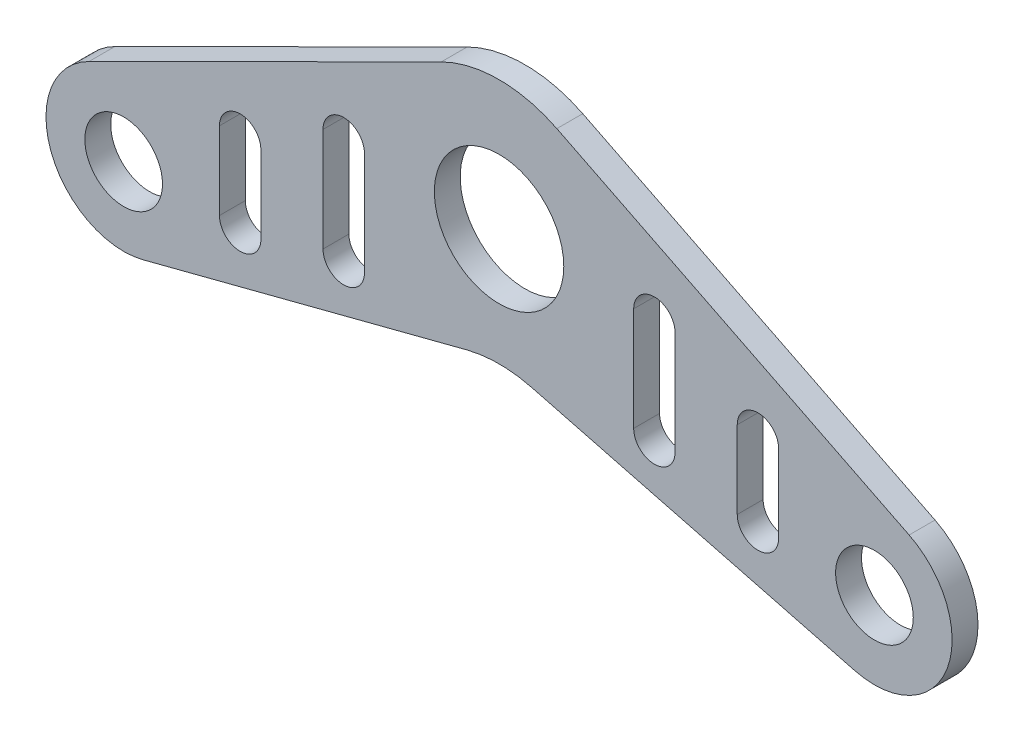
ISO-10303-21;
HEADER;
FILE_DESCRIPTION(('STEP AP214'),'2;1');
FILE_NAME('part.step','',(''),(''),'','','');
FILE_SCHEMA(('AUTOMOTIVE_DESIGN { 1 0 10303 214 1 1 1 1 }'));
ENDSEC;
DATA;
#1=APPLICATION_CONTEXT('core data for automotive mechanical design processes');
#2=APPLICATION_PROTOCOL_DEFINITION('international standard','automotive_design',2000,#1);
#3=PRODUCT_CONTEXT('',#1,'mechanical');
#4=PRODUCT('Part','Part','',(#3));
#5=PRODUCT_RELATED_PRODUCT_CATEGORY('part','',(#4));
#6=PRODUCT_DEFINITION_FORMATION('','',#4);
#7=PRODUCT_DEFINITION_CONTEXT('part definition',#1,'design');
#8=PRODUCT_DEFINITION('design','',#6,#7);
#9=PRODUCT_DEFINITION_SHAPE('','',#8);
#10=(LENGTH_UNIT() NAMED_UNIT(*) SI_UNIT(.MILLI.,.METRE.));
#11=(NAMED_UNIT(*) PLANE_ANGLE_UNIT() SI_UNIT($,.RADIAN.));
#12=(NAMED_UNIT(*) SI_UNIT($,.STERADIAN.) SOLID_ANGLE_UNIT());
#13=UNCERTAINTY_MEASURE_WITH_UNIT(LENGTH_MEASURE(1.E-05),#10,'distance_accuracy_value','');
#14=(GEOMETRIC_REPRESENTATION_CONTEXT(3) GLOBAL_UNCERTAINTY_ASSIGNED_CONTEXT((#13)) GLOBAL_UNIT_ASSIGNED_CONTEXT((#10,
#11,#12)) REPRESENTATION_CONTEXT('',''));
#15=CARTESIAN_POINT('',(0.,0.,0.));
#16=DIRECTION('',(0.,0.,1.));
#17=DIRECTION('',(1.,0.,0.));
#18=AXIS2_PLACEMENT_3D('',#15,#16,#17);
#19=CARTESIAN_POINT('',(-145.,-50.,10.));
#20=DIRECTION('',(0.,0.,1.));
#21=DIRECTION('',(1.,0.,0.));
#22=AXIS2_PLACEMENT_3D('',#19,#20,#21);
#23=PLANE('',#22);
#24=CARTESIAN_POINT('',(-60.,-0.689655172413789,10.));
#25=DIRECTION('',(0.,0.,1.));
#26=DIRECTION('',(1.,0.,0.));
#27=AXIS2_PLACEMENT_3D('',#24,#25,#26);
#28=CIRCLE('',#27,8.);
#29=CARTESIAN_POINT('',(-52.,-0.689655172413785,10.));
#30=VERTEX_POINT('',#29);
#31=CARTESIAN_POINT('',(-68.,-0.689655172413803,10.));
#32=VERTEX_POINT('',#31);
#33=EDGE_CURVE('E313',#30,#32,#28,.T.);
#34=ORIENTED_EDGE('',*,*,#33,.F.);
#35=DIRECTION('',(0.,1.,0.));
#36=VECTOR('',#35,1.);
#37=CARTESIAN_POINT('',(-52.,-0.689655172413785,10.));
#38=LINE('',#37,#36);
#39=CARTESIAN_POINT('',(-52.,-40.6896551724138,10.));
#40=VERTEX_POINT('',#39);
#41=EDGE_CURVE('E324',#40,#30,#38,.T.);
#42=ORIENTED_EDGE('',*,*,#41,.F.);
#43=CARTESIAN_POINT('',(-60.,-40.6896551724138,10.));
#44=DIRECTION('',(0.,0.,1.));
#45=DIRECTION('',(1.,0.,0.));
#46=AXIS2_PLACEMENT_3D('',#43,#44,#45);
#47=CIRCLE('',#46,8.);
#48=CARTESIAN_POINT('',(-68.,-40.6896551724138,10.));
#49=VERTEX_POINT('',#48);
#50=EDGE_CURVE('E320',#49,#40,#47,.T.);
#51=ORIENTED_EDGE('',*,*,#50,.F.);
#52=DIRECTION('',(0.,-1.,0.));
#53=VECTOR('',#52,1.);
#54=CARTESIAN_POINT('',(-68.,-0.689655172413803,10.));
#55=LINE('',#54,#53);
#56=EDGE_CURVE('E316',#32,#49,#55,.T.);
#57=ORIENTED_EDGE('',*,*,#56,.F.);
#58=EDGE_LOOP('',(#34,#42,#51,#57));
#59=FACE_BOUND('',#58,.T.);
#60=CARTESIAN_POINT('',(-100.,-19.4827586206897,10.));
#61=DIRECTION('',(0.,0.,1.));
#62=DIRECTION('',(1.,0.,0.));
#63=AXIS2_PLACEMENT_3D('',#60,#61,#62);
#64=CIRCLE('',#63,7.99999999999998);
#65=CARTESIAN_POINT('',(-92.,-19.4827586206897,10.));
#66=VERTEX_POINT('',#65);
#67=CARTESIAN_POINT('',(-108.,-19.4827586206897,10.));
#68=VERTEX_POINT('',#67);
#69=EDGE_CURVE('E356',#66,#68,#64,.T.);
#70=ORIENTED_EDGE('',*,*,#69,.F.);
#71=DIRECTION('',(0.,1.,0.));
#72=VECTOR('',#71,1.);
#73=CARTESIAN_POINT('',(-92.,-19.4827586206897,10.));
#74=LINE('',#73,#72);
#75=CARTESIAN_POINT('',(-92.,-49.4827586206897,10.));
#76=VERTEX_POINT('',#75);
#77=EDGE_CURVE('E367',#76,#66,#74,.T.);
#78=ORIENTED_EDGE('',*,*,#77,.F.);
#79=CARTESIAN_POINT('',(-100.,-49.4827586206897,10.));
#80=DIRECTION('',(0.,0.,1.));
#81=DIRECTION('',(1.,0.,0.));
#82=AXIS2_PLACEMENT_3D('',#79,#80,#81);
#83=CIRCLE('',#82,7.99999999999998);
#84=CARTESIAN_POINT('',(-108.,-49.4827586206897,10.));
#85=VERTEX_POINT('',#84);
#86=EDGE_CURVE('E363',#85,#76,#83,.T.);
#87=ORIENTED_EDGE('',*,*,#86,.F.);
#88=DIRECTION('',(0.,-1.,0.));
#89=VECTOR('',#88,1.);
#90=CARTESIAN_POINT('',(-108.,-19.4827586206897,10.));
#91=LINE('',#90,#89);
#92=EDGE_CURVE('E359',#68,#85,#91,.T.);
#93=ORIENTED_EDGE('',*,*,#92,.F.);
#94=EDGE_LOOP('',(#70,#78,#87,#93));
#95=FACE_BOUND('',#94,.T.);
#96=CARTESIAN_POINT('',(0.,0.,10.));
#97=DIRECTION('',(0.,0.,1.));
#98=DIRECTION('',(1.,0.,0.));
#99=AXIS2_PLACEMENT_3D('',#96,#97,#98);
#100=CIRCLE('',#99,25.);
#101=CARTESIAN_POINT('',(25.,0.,10.));
#102=VERTEX_POINT('',#101);
#103=EDGE_CURVE('E395',#102,#102,#100,.T.);
#104=ORIENTED_EDGE('',*,*,#103,.F.);
#105=EDGE_LOOP('',(#104));
#106=FACE_BOUND('',#105,.T.);
#107=CARTESIAN_POINT('',(-145.,-50.,10.));
#108=DIRECTION('',(0.,0.,1.));
#109=DIRECTION('',(1.,0.,0.));
#110=AXIS2_PLACEMENT_3D('',#107,#108,#109);
#111=CIRCLE('',#110,30.);
#112=CARTESIAN_POINT('',(-158.394414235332,-23.1561987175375,10.));
#113=VERTEX_POINT('',#112);
#114=CARTESIAN_POINT('',(-137.479425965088,-79.0420551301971,10.));
#115=VERTEX_POINT('',#114);
#116=EDGE_CURVE('E411',#113,#115,#111,.T.);
#117=ORIENTED_EDGE('',*,*,#116,.T.);
#118=DIRECTION('',(0.968068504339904,0.25068580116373,0.));
#119=VECTOR('',#118,1.);
#120=CARTESIAN_POINT('',(-137.479425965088,-79.0420551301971,10.));
#121=LINE('',#120,#119);
#122=CARTESIAN_POINT('',(-12.5342900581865,-46.6869362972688,10.));
#123=VERTEX_POINT('',#122);
#124=EDGE_CURVE('E415',#115,#123,#121,.T.);
#125=ORIENTED_EDGE('',*,*,#124,.T.);
#126=CARTESIAN_POINT('',(0.,-95.090361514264,10.));
#127=DIRECTION('',(0.,0.,-1.));
#128=DIRECTION('',(-1.,0.,0.));
#129=AXIS2_PLACEMENT_3D('',#126,#127,#128);
#130=CIRCLE('',#129,50.);
#131=CARTESIAN_POINT('',(12.5342900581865,-46.6869362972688,10.));
#132=VERTEX_POINT('',#131);
#133=EDGE_CURVE('E419',#123,#132,#130,.T.);
#134=ORIENTED_EDGE('',*,*,#133,.T.);
#135=DIRECTION('',(0.968068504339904,-0.25068580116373,0.));
#136=VECTOR('',#135,1.);
#137=CARTESIAN_POINT('',(12.5342900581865,-46.6869362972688,10.));
#138=LINE('',#137,#136);
#139=CARTESIAN_POINT('',(137.479425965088,-79.0420551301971,10.));
#140=VERTEX_POINT('',#139);
#141=EDGE_CURVE('E422',#132,#140,#138,.T.);
#142=ORIENTED_EDGE('',*,*,#141,.T.);
#143=CARTESIAN_POINT('',(145.,-50.,10.));
#144=DIRECTION('',(0.,0.,1.));
#145=DIRECTION('',(1.,0.,0.));
#146=AXIS2_PLACEMENT_3D('',#143,#144,#145);
#147=CIRCLE('',#146,30.);
#148=CARTESIAN_POINT('',(158.394414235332,-23.1561987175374,10.));
#149=VERTEX_POINT('',#148);
#150=EDGE_CURVE('E425',#140,#149,#147,.T.);
#151=ORIENTED_EDGE('',*,*,#150,.T.);
#152=DIRECTION('',(-0.894793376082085,0.446480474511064,0.));
#153=VECTOR('',#152,1.);
#154=CARTESIAN_POINT('',(22.3240237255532,44.7396688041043,10.));
#155=LINE('',#154,#153);
#156=CARTESIAN_POINT('',(22.3240237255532,44.7396688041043,10.));
#157=VERTEX_POINT('',#156);
#158=EDGE_CURVE('E428',#149,#157,#155,.T.);
#159=ORIENTED_EDGE('',*,*,#158,.T.);
#160=CARTESIAN_POINT('',(0.,0.,10.));
#161=DIRECTION('',(0.,0.,1.));
#162=DIRECTION('',(1.,0.,0.));
#163=AXIS2_PLACEMENT_3D('',#160,#161,#162);
#164=CIRCLE('',#163,50.);
#165=CARTESIAN_POINT('',(-22.3240237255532,44.7396688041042,10.));
#166=VERTEX_POINT('',#165);
#167=EDGE_CURVE('E431',#157,#166,#164,.T.);
#168=ORIENTED_EDGE('',*,*,#167,.T.);
#169=DIRECTION('',(-0.894793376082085,-0.446480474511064,0.));
#170=VECTOR('',#169,1.);
#171=CARTESIAN_POINT('',(-158.394414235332,-23.1561987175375,10.));
#172=LINE('',#171,#170);
#173=EDGE_CURVE('E434',#166,#113,#172,.T.);
#174=ORIENTED_EDGE('',*,*,#173,.T.);
#175=EDGE_LOOP('',(#117,#125,#134,#142,#151,#159,#168,#174));
#176=FACE_BOUND('',#175,.T.);
#177=CARTESIAN_POINT('',(145.,-50.,10.));
#178=DIRECTION('',(0.,0.,1.));
#179=DIRECTION('',(1.,0.,0.));
#180=AXIS2_PLACEMENT_3D('',#177,#178,#179);
#181=CIRCLE('',#180,15.);
#182=CARTESIAN_POINT('',(160.,-50.,10.));
#183=VERTEX_POINT('',#182);
#184=EDGE_CURVE('E403',#183,#183,#181,.T.);
#185=ORIENTED_EDGE('',*,*,#184,.F.);
#186=EDGE_LOOP('',(#185));
#187=FACE_BOUND('',#186,.T.);
#188=CARTESIAN_POINT('',(-145.,-50.,10.));
#189=DIRECTION('',(0.,0.,1.));
#190=DIRECTION('',(1.,0.,0.));
#191=AXIS2_PLACEMENT_3D('',#188,#189,#190);
#192=CIRCLE('',#191,15.);
#193=CARTESIAN_POINT('',(-130.,-50.,10.));
#194=VERTEX_POINT('',#193);
#195=EDGE_CURVE('E387',#194,#194,#192,.T.);
#196=ORIENTED_EDGE('',*,*,#195,.F.);
#197=EDGE_LOOP('',(#196));
#198=FACE_BOUND('',#197,.T.);
#199=DIRECTION('',(0.,1.,0.));
#200=VECTOR('',#199,1.);
#201=CARTESIAN_POINT('',(92.,-19.4827586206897,10.));
#202=LINE('',#201,#200);
#203=CARTESIAN_POINT('',(92.,-49.4827586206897,10.));
#204=VERTEX_POINT('',#203);
#205=CARTESIAN_POINT('',(92.,-19.4827586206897,10.));
#206=VERTEX_POINT('',#205);
#207=EDGE_CURVE('E273',#204,#206,#202,.T.);
#208=ORIENTED_EDGE('',*,*,#207,.T.);
#209=CARTESIAN_POINT('',(100.,-19.4827586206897,10.));
#210=DIRECTION('',(0.,0.,-1.));
#211=DIRECTION('',(-1.,0.,0.));
#212=AXIS2_PLACEMENT_3D('',#209,#210,#211);
#213=CIRCLE('',#212,7.99999999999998);
#214=CARTESIAN_POINT('',(108.,-19.4827586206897,10.));
#215=VERTEX_POINT('',#214);
#216=EDGE_CURVE('E71',#206,#215,#213,.T.);
#217=ORIENTED_EDGE('',*,*,#216,.T.);
#218=DIRECTION('',(0.,-1.,0.));
#219=VECTOR('',#218,1.);
#220=CARTESIAN_POINT('',(108.,-19.4827586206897,10.));
#221=LINE('',#220,#219);
#222=CARTESIAN_POINT('',(108.,-49.4827586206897,10.));
#223=VERTEX_POINT('',#222);
#224=EDGE_CURVE('E281',#215,#223,#221,.T.);
#225=ORIENTED_EDGE('',*,*,#224,.T.);
#226=CARTESIAN_POINT('',(100.,-49.4827586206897,10.));
#227=DIRECTION('',(0.,0.,-1.));
#228=DIRECTION('',(-1.,0.,0.));
#229=AXIS2_PLACEMENT_3D('',#226,#227,#228);
#230=CIRCLE('',#229,7.99999999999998);
#231=EDGE_CURVE('E277',#223,#204,#230,.T.);
#232=ORIENTED_EDGE('',*,*,#231,.T.);
#233=EDGE_LOOP('',(#208,#217,#225,#232));
#234=FACE_BOUND('',#233,.T.);
#235=DIRECTION('',(0.,1.,0.));
#236=VECTOR('',#235,1.);
#237=CARTESIAN_POINT('',(52.,-0.689655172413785,10.));
#238=LINE('',#237,#236);
#239=CARTESIAN_POINT('',(52.,-40.6896551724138,10.));
#240=VERTEX_POINT('',#239);
#241=CARTESIAN_POINT('',(52.,-0.689655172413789,10.));
#242=VERTEX_POINT('',#241);
#243=EDGE_CURVE('E237',#240,#242,#238,.T.);
#244=ORIENTED_EDGE('',*,*,#243,.T.);
#245=CARTESIAN_POINT('',(60.,-0.689655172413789,10.));
#246=DIRECTION('',(0.,0.,-1.));
#247=DIRECTION('',(-1.,0.,0.));
#248=AXIS2_PLACEMENT_3D('',#245,#246,#247);
#249=CIRCLE('',#248,8.);
#250=CARTESIAN_POINT('',(68.,-0.689655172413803,10.));
#251=VERTEX_POINT('',#250);
#252=EDGE_CURVE('E63',#242,#251,#249,.T.);
#253=ORIENTED_EDGE('',*,*,#252,.T.);
#254=DIRECTION('',(0.,-1.,0.));
#255=VECTOR('',#254,1.);
#256=CARTESIAN_POINT('',(68.,-0.689655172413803,10.));
#257=LINE('',#256,#255);
#258=CARTESIAN_POINT('',(68.,-40.6896551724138,10.));
#259=VERTEX_POINT('',#258);
#260=EDGE_CURVE('E228',#251,#259,#257,.T.);
#261=ORIENTED_EDGE('',*,*,#260,.T.);
#262=CARTESIAN_POINT('',(60.,-40.6896551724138,10.));
#263=DIRECTION('',(0.,0.,-1.));
#264=DIRECTION('',(-1.,0.,0.));
#265=AXIS2_PLACEMENT_3D('',#262,#263,#264);
#266=CIRCLE('',#265,8.);
#267=EDGE_CURVE('E245',#259,#240,#266,.T.);
#268=ORIENTED_EDGE('',*,*,#267,.T.);
#269=EDGE_LOOP('',(#244,#253,#261,#268));
#270=FACE_BOUND('',#269,.T.);
#271=ADVANCED_FACE('F47',(#59,#95,#106,#176,#187,#198,#234,#270),#23,.T.);
#272=CARTESIAN_POINT('',(-145.,-50.,0.));
#273=DIRECTION('',(0.,0.,1.));
#274=DIRECTION('',(1.,0.,0.));
#275=AXIS2_PLACEMENT_3D('',#272,#273,#274);
#276=PLANE('',#275);
#277=CARTESIAN_POINT('',(100.,-19.4827586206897,0.));
#278=DIRECTION('',(0.,0.,1.));
#279=DIRECTION('',(1.,0.,0.));
#280=AXIS2_PLACEMENT_3D('',#277,#278,#279);
#281=CIRCLE('',#280,7.99999999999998);
#282=CARTESIAN_POINT('',(108.,-19.4827586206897,0.));
#283=VERTEX_POINT('',#282);
#284=CARTESIAN_POINT('',(92.,-19.4827586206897,0.));
#285=VERTEX_POINT('',#284);
#286=EDGE_CURVE('E267',#283,#285,#281,.T.);
#287=ORIENTED_EDGE('',*,*,#286,.T.);
#288=DIRECTION('',(0.,-1.,0.));
#289=VECTOR('',#288,1.);
#290=CARTESIAN_POINT('',(92.,-19.4827586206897,0.));
#291=LINE('',#290,#289);
#292=CARTESIAN_POINT('',(92.,-49.4827586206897,0.));
#293=VERTEX_POINT('',#292);
#294=EDGE_CURVE('E289',#285,#293,#291,.T.);
#295=ORIENTED_EDGE('',*,*,#294,.T.);
#296=CARTESIAN_POINT('',(100.,-49.4827586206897,0.));
#297=DIRECTION('',(0.,0.,1.));
#298=DIRECTION('',(1.,0.,0.));
#299=AXIS2_PLACEMENT_3D('',#296,#297,#298);
#300=CIRCLE('',#299,7.99999999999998);
#301=CARTESIAN_POINT('',(108.,-49.4827586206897,0.));
#302=VERTEX_POINT('',#301);
#303=EDGE_CURVE('E259',#293,#302,#300,.T.);
#304=ORIENTED_EDGE('',*,*,#303,.T.);
#305=DIRECTION('',(0.,1.,0.));
#306=VECTOR('',#305,1.);
#307=CARTESIAN_POINT('',(108.,-19.4827586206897,0.));
#308=LINE('',#307,#306);
#309=EDGE_CURVE('E263',#302,#283,#308,.T.);
#310=ORIENTED_EDGE('',*,*,#309,.T.);
#311=EDGE_LOOP('',(#287,#295,#304,#310));
#312=FACE_BOUND('',#311,.T.);
#313=DIRECTION('',(0.,-1.,0.));
#314=VECTOR('',#313,1.);
#315=CARTESIAN_POINT('',(-52.,-0.689655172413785,0.));
#316=LINE('',#315,#314);
#317=CARTESIAN_POINT('',(-52.,-0.689655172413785,0.));
#318=VERTEX_POINT('',#317);
#319=CARTESIAN_POINT('',(-52.,-40.6896551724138,0.));
#320=VERTEX_POINT('',#319);
#321=EDGE_CURVE('E304',#318,#320,#316,.T.);
#322=ORIENTED_EDGE('',*,*,#321,.F.);
#323=CARTESIAN_POINT('',(-60.,-0.689655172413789,0.));
#324=DIRECTION('',(0.,0.,1.));
#325=DIRECTION('',(1.,0.,0.));
#326=AXIS2_PLACEMENT_3D('',#323,#324,#325);
#327=CIRCLE('',#326,8.);
#328=CARTESIAN_POINT('',(-68.,-0.689655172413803,0.));
#329=VERTEX_POINT('',#328);
#330=EDGE_CURVE('E309',#329,#318,#327,.F.);
#331=ORIENTED_EDGE('',*,*,#330,.F.);
#332=DIRECTION('',(0.,1.,0.));
#333=VECTOR('',#332,1.);
#334=CARTESIAN_POINT('',(-68.,-0.689655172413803,0.));
#335=LINE('',#334,#333);
#336=CARTESIAN_POINT('',(-68.,-40.6896551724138,0.));
#337=VERTEX_POINT('',#336);
#338=EDGE_CURVE('E332',#337,#329,#335,.T.);
#339=ORIENTED_EDGE('',*,*,#338,.F.);
#340=CARTESIAN_POINT('',(-60.,-40.6896551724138,0.));
#341=DIRECTION('',(0.,0.,1.));
#342=DIRECTION('',(1.,0.,0.));
#343=AXIS2_PLACEMENT_3D('',#340,#341,#342);
#344=CIRCLE('',#343,8.);
#345=EDGE_CURVE('E301',#320,#337,#344,.F.);
#346=ORIENTED_EDGE('',*,*,#345,.F.);
#347=EDGE_LOOP('',(#322,#331,#339,#346));
#348=FACE_BOUND('',#347,.T.);
#349=DIRECTION('',(0.,-1.,0.));
#350=VECTOR('',#349,1.);
#351=CARTESIAN_POINT('',(-92.,-19.4827586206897,0.));
#352=LINE('',#351,#350);
#353=CARTESIAN_POINT('',(-92.,-19.4827586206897,0.));
#354=VERTEX_POINT('',#353);
#355=CARTESIAN_POINT('',(-92.,-49.4827586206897,0.));
#356=VERTEX_POINT('',#355);
#357=EDGE_CURVE('E348',#354,#356,#352,.T.);
#358=ORIENTED_EDGE('',*,*,#357,.F.);
#359=CARTESIAN_POINT('',(-100.,-19.4827586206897,0.));
#360=DIRECTION('',(0.,0.,1.));
#361=DIRECTION('',(1.,0.,0.));
#362=AXIS2_PLACEMENT_3D('',#359,#360,#361);
#363=CIRCLE('',#362,7.99999999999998);
#364=CARTESIAN_POINT('',(-108.,-19.4827586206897,0.));
#365=VERTEX_POINT('',#364);
#366=EDGE_CURVE('E352',#365,#354,#363,.F.);
#367=ORIENTED_EDGE('',*,*,#366,.F.);
#368=DIRECTION('',(0.,1.,0.));
#369=VECTOR('',#368,1.);
#370=CARTESIAN_POINT('',(-108.,-19.4827586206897,0.));
#371=LINE('',#370,#369);
#372=CARTESIAN_POINT('',(-108.,-49.4827586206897,0.));
#373=VERTEX_POINT('',#372);
#374=EDGE_CURVE('E305',#373,#365,#371,.T.);
#375=ORIENTED_EDGE('',*,*,#374,.F.);
#376=CARTESIAN_POINT('',(-100.,-49.4827586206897,0.));
#377=DIRECTION('',(0.,0.,1.));
#378=DIRECTION('',(1.,0.,0.));
#379=AXIS2_PLACEMENT_3D('',#376,#377,#378);
#380=CIRCLE('',#379,7.99999999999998);
#381=EDGE_CURVE('E221',#356,#373,#380,.F.);
#382=ORIENTED_EDGE('',*,*,#381,.F.);
#383=EDGE_LOOP('',(#358,#367,#375,#382));
#384=FACE_BOUND('',#383,.T.);
#385=CARTESIAN_POINT('',(-145.,-50.,0.));
#386=DIRECTION('',(0.,0.,1.));
#387=DIRECTION('',(1.,0.,0.));
#388=AXIS2_PLACEMENT_3D('',#385,#386,#387);
#389=CIRCLE('',#388,30.);
#390=CARTESIAN_POINT('',(-158.394414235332,-23.1561987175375,0.));
#391=VERTEX_POINT('',#390);
#392=CARTESIAN_POINT('',(-137.479425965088,-79.0420551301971,0.));
#393=VERTEX_POINT('',#392);
#394=EDGE_CURVE('E407',#391,#393,#389,.T.);
#395=ORIENTED_EDGE('',*,*,#394,.F.);
#396=DIRECTION('',(-0.894793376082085,-0.446480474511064,0.));
#397=VECTOR('',#396,1.);
#398=CARTESIAN_POINT('',(-158.394414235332,-23.1561987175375,0.));
#399=LINE('',#398,#397);
#400=CARTESIAN_POINT('',(-22.3240237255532,44.7396688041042,0.));
#401=VERTEX_POINT('',#400);
#402=EDGE_CURVE('E416',#401,#391,#399,.T.);
#403=ORIENTED_EDGE('',*,*,#402,.F.);
#404=CARTESIAN_POINT('',(0.,0.,0.));
#405=DIRECTION('',(0.,0.,1.));
#406=DIRECTION('',(1.,0.,0.));
#407=AXIS2_PLACEMENT_3D('',#404,#405,#406);
#408=CIRCLE('',#407,50.);
#409=CARTESIAN_POINT('',(22.3240237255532,44.7396688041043,0.));
#410=VERTEX_POINT('',#409);
#411=EDGE_CURVE('E456',#410,#401,#408,.T.);
#412=ORIENTED_EDGE('',*,*,#411,.F.);
#413=DIRECTION('',(-0.894793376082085,0.446480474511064,0.));
#414=VECTOR('',#413,1.);
#415=CARTESIAN_POINT('',(22.3240237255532,44.7396688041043,0.));
#416=LINE('',#415,#414);
#417=CARTESIAN_POINT('',(158.394414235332,-23.1561987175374,0.));
#418=VERTEX_POINT('',#417);
#419=EDGE_CURVE('E453',#418,#410,#416,.T.);
#420=ORIENTED_EDGE('',*,*,#419,.F.);
#421=CARTESIAN_POINT('',(145.,-50.,0.));
#422=DIRECTION('',(0.,0.,1.));
#423=DIRECTION('',(1.,0.,0.));
#424=AXIS2_PLACEMENT_3D('',#421,#422,#423);
#425=CIRCLE('',#424,30.);
#426=CARTESIAN_POINT('',(137.479425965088,-79.0420551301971,0.));
#427=VERTEX_POINT('',#426);
#428=EDGE_CURVE('E450',#427,#418,#425,.T.);
#429=ORIENTED_EDGE('',*,*,#428,.F.);
#430=DIRECTION('',(0.968068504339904,-0.25068580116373,0.));
#431=VECTOR('',#430,1.);
#432=CARTESIAN_POINT('',(12.5342900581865,-46.6869362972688,0.));
#433=LINE('',#432,#431);
#434=CARTESIAN_POINT('',(12.5342900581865,-46.6869362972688,0.));
#435=VERTEX_POINT('',#434);
#436=EDGE_CURVE('E447',#435,#427,#433,.T.);
#437=ORIENTED_EDGE('',*,*,#436,.F.);
#438=CARTESIAN_POINT('',(0.,-95.090361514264,0.));
#439=DIRECTION('',(0.,0.,-1.));
#440=DIRECTION('',(-1.,0.,0.));
#441=AXIS2_PLACEMENT_3D('',#438,#439,#440);
#442=CIRCLE('',#441,50.);
#443=CARTESIAN_POINT('',(-12.5342900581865,-46.6869362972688,0.));
#444=VERTEX_POINT('',#443);
#445=EDGE_CURVE('E444',#444,#435,#442,.T.);
#446=ORIENTED_EDGE('',*,*,#445,.F.);
#447=DIRECTION('',(0.968068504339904,0.25068580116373,0.));
#448=VECTOR('',#447,1.);
#449=CARTESIAN_POINT('',(-137.479425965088,-79.0420551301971,0.));
#450=LINE('',#449,#448);
#451=EDGE_CURVE('E441',#393,#444,#450,.T.);
#452=ORIENTED_EDGE('',*,*,#451,.F.);
#453=EDGE_LOOP('',(#395,#403,#412,#420,#429,#437,#446,#452));
#454=FACE_BOUND('',#453,.T.);
#455=CARTESIAN_POINT('',(145.,-50.,0.));
#456=DIRECTION('',(0.,0.,1.));
#457=DIRECTION('',(1.,0.,0.));
#458=AXIS2_PLACEMENT_3D('',#455,#456,#457);
#459=CIRCLE('',#458,15.);
#460=CARTESIAN_POINT('',(160.,-50.,0.));
#461=VERTEX_POINT('',#460);
#462=EDGE_CURVE('E399',#461,#461,#459,.T.);
#463=ORIENTED_EDGE('',*,*,#462,.T.);
#464=EDGE_LOOP('',(#463));
#465=FACE_BOUND('',#464,.T.);
#466=CARTESIAN_POINT('',(0.,0.,0.));
#467=DIRECTION('',(0.,0.,1.));
#468=DIRECTION('',(1.,0.,0.));
#469=AXIS2_PLACEMENT_3D('',#466,#467,#468);
#470=CIRCLE('',#469,25.);
#471=CARTESIAN_POINT('',(25.,0.,0.));
#472=VERTEX_POINT('',#471);
#473=EDGE_CURVE('E391',#472,#472,#470,.T.);
#474=ORIENTED_EDGE('',*,*,#473,.T.);
#475=EDGE_LOOP('',(#474));
#476=FACE_BOUND('',#475,.T.);
#477=CARTESIAN_POINT('',(-145.,-50.,0.));
#478=DIRECTION('',(0.,0.,1.));
#479=DIRECTION('',(1.,0.,0.));
#480=AXIS2_PLACEMENT_3D('',#477,#478,#479);
#481=CIRCLE('',#480,15.);
#482=CARTESIAN_POINT('',(-130.,-50.,0.));
#483=VERTEX_POINT('',#482);
#484=EDGE_CURVE('E345',#483,#483,#481,.T.);
#485=ORIENTED_EDGE('',*,*,#484,.T.);
#486=EDGE_LOOP('',(#485));
#487=FACE_BOUND('',#486,.T.);
#488=CARTESIAN_POINT('',(60.,-0.689655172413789,0.));
#489=DIRECTION('',(0.,0.,1.));
#490=DIRECTION('',(1.,0.,0.));
#491=AXIS2_PLACEMENT_3D('',#488,#489,#490);
#492=CIRCLE('',#491,8.);
#493=CARTESIAN_POINT('',(68.,-0.689655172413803,0.));
#494=VERTEX_POINT('',#493);
#495=CARTESIAN_POINT('',(52.,-0.689655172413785,0.));
#496=VERTEX_POINT('',#495);
#497=EDGE_CURVE('E225',#494,#496,#492,.T.);
#498=ORIENTED_EDGE('',*,*,#497,.T.);
#499=DIRECTION('',(0.,-1.,0.));
#500=VECTOR('',#499,1.);
#501=CARTESIAN_POINT('',(52.,-0.689655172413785,0.));
#502=LINE('',#501,#500);
#503=CARTESIAN_POINT('',(52.,-40.6896551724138,0.));
#504=VERTEX_POINT('',#503);
#505=EDGE_CURVE('E210',#496,#504,#502,.T.);
#506=ORIENTED_EDGE('',*,*,#505,.T.);
#507=CARTESIAN_POINT('',(60.,-40.6896551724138,0.));
#508=DIRECTION('',(0.,0.,1.));
#509=DIRECTION('',(1.,0.,0.));
#510=AXIS2_PLACEMENT_3D('',#507,#508,#509);
#511=CIRCLE('',#510,8.);
#512=CARTESIAN_POINT('',(68.,-40.6896551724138,0.));
#513=VERTEX_POINT('',#512);
#514=EDGE_CURVE('E239',#504,#513,#511,.T.);
#515=ORIENTED_EDGE('',*,*,#514,.T.);
#516=DIRECTION('',(0.,1.,0.));
#517=VECTOR('',#516,1.);
#518=CARTESIAN_POINT('',(68.,-0.689655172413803,0.));
#519=LINE('',#518,#517);
#520=EDGE_CURVE('E232',#513,#494,#519,.T.);
#521=ORIENTED_EDGE('',*,*,#520,.T.);
#522=EDGE_LOOP('',(#498,#506,#515,#521));
#523=FACE_BOUND('',#522,.T.);
#524=ADVANCED_FACE('F231',(#312,#348,#384,#454,#465,#476,#487,#523),#276,.F.);
#525=CARTESIAN_POINT('',(-145.,-50.,10.));
#526=DIRECTION('',(0.,0.,-1.));
#527=DIRECTION('',(-1.,0.,0.));
#528=AXIS2_PLACEMENT_3D('',#525,#526,#527);
#529=CYLINDRICAL_SURFACE('',#528,30.);
#530=ORIENTED_EDGE('',*,*,#394,.T.);
#531=DIRECTION('',(0.,0.,-1.));
#532=VECTOR('',#531,1.);
#533=CARTESIAN_POINT('',(-137.479425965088,-79.0420551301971,10.));
#534=LINE('',#533,#532);
#535=EDGE_CURVE('E11',#115,#393,#534,.T.);
#536=ORIENTED_EDGE('',*,*,#535,.F.);
#537=ORIENTED_EDGE('',*,*,#116,.F.);
#538=DIRECTION('',(0.,0.,-1.));
#539=VECTOR('',#538,1.);
#540=CARTESIAN_POINT('',(-158.394414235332,-23.1561987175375,10.));
#541=LINE('',#540,#539);
#542=EDGE_CURVE('E437',#113,#391,#541,.T.);
#543=ORIENTED_EDGE('',*,*,#542,.T.);
#544=EDGE_LOOP('',(#530,#536,#537,#543));
#545=FACE_BOUND('',#544,.T.);
#546=ADVANCED_FACE('F49',(#545),#529,.T.);
#547=CARTESIAN_POINT('',(-137.479425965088,-79.0420551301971,10.));
#548=DIRECTION('',(-0.25068580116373,0.968068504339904,0.));
#549=DIRECTION('',(-0.968068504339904,-0.25068580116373,0.));
#550=AXIS2_PLACEMENT_3D('',#547,#548,#549);
#551=PLANE('',#550);
#552=ORIENTED_EDGE('',*,*,#451,.T.);
#553=DIRECTION('',(0.,0.,-1.));
#554=VECTOR('',#553,1.);
#555=CARTESIAN_POINT('',(-12.5342900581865,-46.6869362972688,10.));
#556=LINE('',#555,#554);
#557=EDGE_CURVE('E56',#123,#444,#556,.T.);
#558=ORIENTED_EDGE('',*,*,#557,.F.);
#559=ORIENTED_EDGE('',*,*,#124,.F.);
#560=ORIENTED_EDGE('',*,*,#535,.T.);
#561=EDGE_LOOP('',(#552,#558,#559,#560));
#562=FACE_BOUND('',#561,.T.);
#563=ADVANCED_FACE('F512',(#562),#551,.F.);
#564=CARTESIAN_POINT('',(0.,-95.090361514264,10.));
#565=DIRECTION('',(0.,0.,-1.));
#566=DIRECTION('',(-1.,0.,0.));
#567=AXIS2_PLACEMENT_3D('',#564,#565,#566);
#568=CYLINDRICAL_SURFACE('',#567,50.);
#569=ORIENTED_EDGE('',*,*,#445,.T.);
#570=DIRECTION('',(0.,0.,-1.));
#571=VECTOR('',#570,1.);
#572=CARTESIAN_POINT('',(12.5342900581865,-46.6869362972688,10.));
#573=LINE('',#572,#571);
#574=EDGE_CURVE('E480',#132,#435,#573,.T.);
#575=ORIENTED_EDGE('',*,*,#574,.F.);
#576=ORIENTED_EDGE('',*,*,#133,.F.);
#577=ORIENTED_EDGE('',*,*,#557,.T.);
#578=EDGE_LOOP('',(#569,#575,#576,#577));
#579=FACE_BOUND('',#578,.T.);
#580=ADVANCED_FACE('F489',(#579),#568,.F.);
#581=CARTESIAN_POINT('',(12.5342900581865,-46.6869362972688,10.));
#582=DIRECTION('',(0.25068580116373,0.968068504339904,0.));
#583=DIRECTION('',(-0.968068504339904,0.25068580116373,0.));
#584=AXIS2_PLACEMENT_3D('',#581,#582,#583);
#585=PLANE('',#584);
#586=ORIENTED_EDGE('',*,*,#436,.T.);
#587=DIRECTION('',(0.,0.,-1.));
#588=VECTOR('',#587,1.);
#589=CARTESIAN_POINT('',(137.479425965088,-79.0420551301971,10.));
#590=LINE('',#589,#588);
#591=EDGE_CURVE('E476',#140,#427,#590,.T.);
#592=ORIENTED_EDGE('',*,*,#591,.F.);
#593=ORIENTED_EDGE('',*,*,#141,.F.);
#594=ORIENTED_EDGE('',*,*,#574,.T.);
#595=EDGE_LOOP('',(#586,#592,#593,#594));
#596=FACE_BOUND('',#595,.T.);
#597=ADVANCED_FACE('F500',(#596),#585,.F.);
#598=CARTESIAN_POINT('',(145.,-50.,10.));
#599=DIRECTION('',(0.,0.,-1.));
#600=DIRECTION('',(-1.,0.,0.));
#601=AXIS2_PLACEMENT_3D('',#598,#599,#600);
#602=CYLINDRICAL_SURFACE('',#601,30.);
#603=ORIENTED_EDGE('',*,*,#428,.T.);
#604=DIRECTION('',(0.,0.,-1.));
#605=VECTOR('',#604,1.);
#606=CARTESIAN_POINT('',(158.394414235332,-23.1561987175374,10.));
#607=LINE('',#606,#605);
#608=EDGE_CURVE('E472',#149,#418,#607,.T.);
#609=ORIENTED_EDGE('',*,*,#608,.F.);
#610=ORIENTED_EDGE('',*,*,#150,.F.);
#611=ORIENTED_EDGE('',*,*,#591,.T.);
#612=EDGE_LOOP('',(#603,#609,#610,#611));
#613=FACE_BOUND('',#612,.T.);
#614=ADVANCED_FACE('F504',(#613),#602,.T.);
#615=CARTESIAN_POINT('',(22.3240237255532,44.7396688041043,10.));
#616=DIRECTION('',(-0.446480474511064,-0.894793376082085,0.));
#617=DIRECTION('',(0.894793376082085,-0.446480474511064,0.));
#618=AXIS2_PLACEMENT_3D('',#615,#616,#617);
#619=PLANE('',#618);
#620=ORIENTED_EDGE('',*,*,#419,.T.);
#621=DIRECTION('',(0.,0.,-1.));
#622=VECTOR('',#621,1.);
#623=CARTESIAN_POINT('',(22.3240237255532,44.7396688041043,10.));
#624=LINE('',#623,#622);
#625=EDGE_CURVE('E468',#157,#410,#624,.T.);
#626=ORIENTED_EDGE('',*,*,#625,.F.);
#627=ORIENTED_EDGE('',*,*,#158,.F.);
#628=ORIENTED_EDGE('',*,*,#608,.T.);
#629=EDGE_LOOP('',(#620,#626,#627,#628));
#630=FACE_BOUND('',#629,.T.);
#631=ADVANCED_FACE('F525',(#630),#619,.F.);
#632=CARTESIAN_POINT('',(0.,0.,10.));
#633=DIRECTION('',(0.,0.,-1.));
#634=DIRECTION('',(-1.,0.,0.));
#635=AXIS2_PLACEMENT_3D('',#632,#633,#634);
#636=CYLINDRICAL_SURFACE('',#635,50.);
#637=ORIENTED_EDGE('',*,*,#411,.T.);
#638=DIRECTION('',(0.,0.,-1.));
#639=VECTOR('',#638,1.);
#640=CARTESIAN_POINT('',(-22.3240237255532,44.7396688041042,10.));
#641=LINE('',#640,#639);
#642=EDGE_CURVE('E464',#166,#401,#641,.T.);
#643=ORIENTED_EDGE('',*,*,#642,.F.);
#644=ORIENTED_EDGE('',*,*,#167,.F.);
#645=ORIENTED_EDGE('',*,*,#625,.T.);
#646=EDGE_LOOP('',(#637,#643,#644,#645));
#647=FACE_BOUND('',#646,.T.);
#648=ADVANCED_FACE('F523',(#647),#636,.T.);
#649=CARTESIAN_POINT('',(-158.394414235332,-23.1561987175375,10.));
#650=DIRECTION('',(0.446480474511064,-0.894793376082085,0.));
#651=DIRECTION('',(0.894793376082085,0.446480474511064,0.));
#652=AXIS2_PLACEMENT_3D('',#649,#650,#651);
#653=PLANE('',#652);
#654=ORIENTED_EDGE('',*,*,#402,.T.);
#655=ORIENTED_EDGE('',*,*,#542,.F.);
#656=ORIENTED_EDGE('',*,*,#173,.F.);
#657=ORIENTED_EDGE('',*,*,#642,.T.);
#658=EDGE_LOOP('',(#654,#655,#656,#657));
#659=FACE_BOUND('',#658,.T.);
#660=ADVANCED_FACE('F518',(#659),#653,.F.);
#661=CARTESIAN_POINT('',(145.,-50.,10.));
#662=DIRECTION('',(0.,0.,-1.));
#663=DIRECTION('',(-1.,0.,0.));
#664=AXIS2_PLACEMENT_3D('',#661,#662,#663);
#665=CYLINDRICAL_SURFACE('',#664,15.);
#666=ORIENTED_EDGE('',*,*,#184,.T.);
#667=EDGE_LOOP('',(#666));
#668=FACE_BOUND('',#667,.T.);
#669=ORIENTED_EDGE('',*,*,#462,.F.);
#670=EDGE_LOOP('',(#669));
#671=FACE_BOUND('',#670,.T.);
#672=ADVANCED_FACE('F546',(#668,#671),#665,.F.);
#673=CARTESIAN_POINT('',(0.,0.,10.));
#674=DIRECTION('',(0.,0.,-1.));
#675=DIRECTION('',(-1.,0.,0.));
#676=AXIS2_PLACEMENT_3D('',#673,#674,#675);
#677=CYLINDRICAL_SURFACE('',#676,25.);
#678=ORIENTED_EDGE('',*,*,#103,.T.);
#679=EDGE_LOOP('',(#678));
#680=FACE_BOUND('',#679,.T.);
#681=ORIENTED_EDGE('',*,*,#473,.F.);
#682=EDGE_LOOP('',(#681));
#683=FACE_BOUND('',#682,.T.);
#684=ADVANCED_FACE('F553',(#680,#683),#677,.F.);
#685=CARTESIAN_POINT('',(-145.,-50.,10.));
#686=DIRECTION('',(0.,0.,-1.));
#687=DIRECTION('',(-1.,0.,0.));
#688=AXIS2_PLACEMENT_3D('',#685,#686,#687);
#689=CYLINDRICAL_SURFACE('',#688,15.);
#690=ORIENTED_EDGE('',*,*,#195,.T.);
#691=EDGE_LOOP('',(#690));
#692=FACE_BOUND('',#691,.T.);
#693=ORIENTED_EDGE('',*,*,#484,.F.);
#694=EDGE_LOOP('',(#693));
#695=FACE_BOUND('',#694,.T.);
#696=ADVANCED_FACE('F558',(#692,#695),#689,.F.);
#697=CARTESIAN_POINT('',(-100.,-19.4827586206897,-0.000999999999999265));
#698=DIRECTION('',(0.,0.,1.));
#699=DIRECTION('',(1.,0.,0.));
#700=AXIS2_PLACEMENT_3D('',#697,#698,#699);
#701=CYLINDRICAL_SURFACE('',#700,7.99999999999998);
#702=ORIENTED_EDGE('',*,*,#366,.T.);
#703=DIRECTION('',(0.,0.,1.));
#704=VECTOR('',#703,1.);
#705=CARTESIAN_POINT('',(-92.,-19.4827586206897,-0.000999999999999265));
#706=LINE('',#705,#704);
#707=EDGE_CURVE('E372',#354,#66,#706,.T.);
#708=ORIENTED_EDGE('',*,*,#707,.T.);
#709=ORIENTED_EDGE('',*,*,#69,.T.);
#710=DIRECTION('',(0.,0.,1.));
#711=VECTOR('',#710,1.);
#712=CARTESIAN_POINT('',(-108.,-19.4827586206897,-0.000999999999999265));
#713=LINE('',#712,#711);
#714=EDGE_CURVE('E371',#365,#68,#713,.T.);
#715=ORIENTED_EDGE('',*,*,#714,.F.);
#716=EDGE_LOOP('',(#702,#708,#709,#715));
#717=FACE_BOUND('',#716,.T.);
#718=ADVANCED_FACE('F569',(#717),#701,.F.);
#719=CARTESIAN_POINT('',(-92.,-19.4827586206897,-0.000999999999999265));
#720=DIRECTION('',(1.,0.,0.));
#721=DIRECTION('',(0.,1.,0.));
#722=AXIS2_PLACEMENT_3D('',#719,#720,#721);
#723=PLANE('',#722);
#724=ORIENTED_EDGE('',*,*,#357,.T.);
#725=DIRECTION('',(0.,0.,1.));
#726=VECTOR('',#725,1.);
#727=CARTESIAN_POINT('',(-92.,-49.4827586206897,-0.000999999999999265));
#728=LINE('',#727,#726);
#729=EDGE_CURVE('E375',#356,#76,#728,.T.);
#730=ORIENTED_EDGE('',*,*,#729,.T.);
#731=ORIENTED_EDGE('',*,*,#77,.T.);
#732=ORIENTED_EDGE('',*,*,#707,.F.);
#733=EDGE_LOOP('',(#724,#730,#731,#732));
#734=FACE_BOUND('',#733,.T.);
#735=ADVANCED_FACE('F575',(#734),#723,.F.);
#736=CARTESIAN_POINT('',(-100.,-49.4827586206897,-0.000999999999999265));
#737=DIRECTION('',(0.,0.,1.));
#738=DIRECTION('',(1.,0.,0.));
#739=AXIS2_PLACEMENT_3D('',#736,#737,#738);
#740=CYLINDRICAL_SURFACE('',#739,7.99999999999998);
#741=ORIENTED_EDGE('',*,*,#381,.T.);
#742=DIRECTION('',(0.,0.,1.));
#743=VECTOR('',#742,1.);
#744=CARTESIAN_POINT('',(-108.,-49.4827586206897,-0.000999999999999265));
#745=LINE('',#744,#743);
#746=EDGE_CURVE('E378',#373,#85,#745,.T.);
#747=ORIENTED_EDGE('',*,*,#746,.T.);
#748=ORIENTED_EDGE('',*,*,#86,.T.);
#749=ORIENTED_EDGE('',*,*,#729,.F.);
#750=EDGE_LOOP('',(#741,#747,#748,#749));
#751=FACE_BOUND('',#750,.T.);
#752=ADVANCED_FACE('F583',(#751),#740,.F.);
#753=CARTESIAN_POINT('',(-108.,-19.4827586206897,-0.000999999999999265));
#754=DIRECTION('',(-1.,0.,0.));
#755=DIRECTION('',(0.,-1.,0.));
#756=AXIS2_PLACEMENT_3D('',#753,#754,#755);
#757=PLANE('',#756);
#758=ORIENTED_EDGE('',*,*,#374,.T.);
#759=ORIENTED_EDGE('',*,*,#714,.T.);
#760=ORIENTED_EDGE('',*,*,#92,.T.);
#761=ORIENTED_EDGE('',*,*,#746,.F.);
#762=EDGE_LOOP('',(#758,#759,#760,#761));
#763=FACE_BOUND('',#762,.T.);
#764=ADVANCED_FACE('F579',(#763),#757,.F.);
#765=CARTESIAN_POINT('',(-60.,-0.689655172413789,-0.000999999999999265));
#766=DIRECTION('',(0.,0.,1.));
#767=DIRECTION('',(1.,0.,0.));
#768=AXIS2_PLACEMENT_3D('',#765,#766,#767);
#769=CYLINDRICAL_SURFACE('',#768,8.);
#770=ORIENTED_EDGE('',*,*,#330,.T.);
#771=DIRECTION('',(0.,0.,1.));
#772=VECTOR('',#771,1.);
#773=CARTESIAN_POINT('',(-52.,-0.689655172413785,-0.000999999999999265));
#774=LINE('',#773,#772);
#775=EDGE_CURVE('E329',#318,#30,#774,.T.);
#776=ORIENTED_EDGE('',*,*,#775,.T.);
#777=ORIENTED_EDGE('',*,*,#33,.T.);
#778=DIRECTION('',(0.,0.,1.));
#779=VECTOR('',#778,1.);
#780=CARTESIAN_POINT('',(-68.,-0.689655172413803,-0.000999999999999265));
#781=LINE('',#780,#779);
#782=EDGE_CURVE('E328',#329,#32,#781,.T.);
#783=ORIENTED_EDGE('',*,*,#782,.F.);
#784=EDGE_LOOP('',(#770,#776,#777,#783));
#785=FACE_BOUND('',#784,.T.);
#786=ADVANCED_FACE('F582',(#785),#769,.F.);
#787=CARTESIAN_POINT('',(-52.,-0.689655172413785,-0.000999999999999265));
#788=DIRECTION('',(1.,0.,0.));
#789=DIRECTION('',(0.,1.,0.));
#790=AXIS2_PLACEMENT_3D('',#787,#788,#789);
#791=PLANE('',#790);
#792=ORIENTED_EDGE('',*,*,#321,.T.);
#793=DIRECTION('',(0.,0.,1.));
#794=VECTOR('',#793,1.);
#795=CARTESIAN_POINT('',(-52.,-40.6896551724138,-0.000999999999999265));
#796=LINE('',#795,#794);
#797=EDGE_CURVE('E333',#320,#40,#796,.T.);
#798=ORIENTED_EDGE('',*,*,#797,.T.);
#799=ORIENTED_EDGE('',*,*,#41,.T.);
#800=ORIENTED_EDGE('',*,*,#775,.F.);
#801=EDGE_LOOP('',(#792,#798,#799,#800));
#802=FACE_BOUND('',#801,.T.);
#803=ADVANCED_FACE('F593',(#802),#791,.F.);
#804=CARTESIAN_POINT('',(-60.,-40.6896551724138,-0.000999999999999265));
#805=DIRECTION('',(0.,0.,1.));
#806=DIRECTION('',(1.,0.,0.));
#807=AXIS2_PLACEMENT_3D('',#804,#805,#806);
#808=CYLINDRICAL_SURFACE('',#807,8.);
#809=ORIENTED_EDGE('',*,*,#345,.T.);
#810=DIRECTION('',(0.,0.,1.));
#811=VECTOR('',#810,1.);
#812=CARTESIAN_POINT('',(-68.,-40.6896551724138,-0.000999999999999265));
#813=LINE('',#812,#811);
#814=EDGE_CURVE('E336',#337,#49,#813,.T.);
#815=ORIENTED_EDGE('',*,*,#814,.T.);
#816=ORIENTED_EDGE('',*,*,#50,.T.);
#817=ORIENTED_EDGE('',*,*,#797,.F.);
#818=EDGE_LOOP('',(#809,#815,#816,#817));
#819=FACE_BOUND('',#818,.T.);
#820=ADVANCED_FACE('F598',(#819),#808,.F.);
#821=CARTESIAN_POINT('',(-68.,-0.689655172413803,-0.000999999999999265));
#822=DIRECTION('',(-1.,0.,0.));
#823=DIRECTION('',(0.,-1.,0.));
#824=AXIS2_PLACEMENT_3D('',#821,#822,#823);
#825=PLANE('',#824);
#826=ORIENTED_EDGE('',*,*,#338,.T.);
#827=ORIENTED_EDGE('',*,*,#782,.T.);
#828=ORIENTED_EDGE('',*,*,#56,.T.);
#829=ORIENTED_EDGE('',*,*,#814,.F.);
#830=EDGE_LOOP('',(#826,#827,#828,#829));
#831=FACE_BOUND('',#830,.T.);
#832=ADVANCED_FACE('F595',(#831),#825,.F.);
#833=CARTESIAN_POINT('',(100.,-19.4827586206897,-0.000999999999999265));
#834=DIRECTION('',(0.,0.,1.));
#835=DIRECTION('',(1.,0.,0.));
#836=AXIS2_PLACEMENT_3D('',#833,#834,#835);
#837=CYLINDRICAL_SURFACE('',#836,7.99999999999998);
#838=DIRECTION('',(0.,0.,1.));
#839=VECTOR('',#838,1.);
#840=CARTESIAN_POINT('',(108.,-19.4827586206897,-0.000999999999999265));
#841=LINE('',#840,#839);
#842=EDGE_CURVE('E286',#283,#215,#841,.T.);
#843=ORIENTED_EDGE('',*,*,#842,.T.);
#844=ORIENTED_EDGE('',*,*,#216,.F.);
#845=DIRECTION('',(0.,0.,1.));
#846=VECTOR('',#845,1.);
#847=CARTESIAN_POINT('',(92.,-19.4827586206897,-0.000999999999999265));
#848=LINE('',#847,#846);
#849=EDGE_CURVE('E285',#285,#206,#848,.T.);
#850=ORIENTED_EDGE('',*,*,#849,.F.);
#851=ORIENTED_EDGE('',*,*,#286,.F.);
#852=EDGE_LOOP('',(#843,#844,#850,#851));
#853=FACE_BOUND('',#852,.T.);
#854=ADVANCED_FACE('F597',(#853),#837,.F.);
#855=CARTESIAN_POINT('',(108.,-19.4827586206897,-0.000999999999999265));
#856=DIRECTION('',(-1.,0.,0.));
#857=DIRECTION('',(0.,-1.,0.));
#858=AXIS2_PLACEMENT_3D('',#855,#856,#857);
#859=PLANE('',#858);
#860=DIRECTION('',(0.,0.,1.));
#861=VECTOR('',#860,1.);
#862=CARTESIAN_POINT('',(108.,-49.4827586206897,-0.000999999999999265));
#863=LINE('',#862,#861);
#864=EDGE_CURVE('E290',#302,#223,#863,.T.);
#865=ORIENTED_EDGE('',*,*,#864,.T.);
#866=ORIENTED_EDGE('',*,*,#224,.F.);
#867=ORIENTED_EDGE('',*,*,#842,.F.);
#868=ORIENTED_EDGE('',*,*,#309,.F.);
#869=EDGE_LOOP('',(#865,#866,#867,#868));
#870=FACE_BOUND('',#869,.T.);
#871=ADVANCED_FACE('F608',(#870),#859,.T.);
#872=CARTESIAN_POINT('',(100.,-49.4827586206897,-0.000999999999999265));
#873=DIRECTION('',(0.,0.,1.));
#874=DIRECTION('',(1.,0.,0.));
#875=AXIS2_PLACEMENT_3D('',#872,#873,#874);
#876=CYLINDRICAL_SURFACE('',#875,7.99999999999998);
#877=DIRECTION('',(0.,0.,1.));
#878=VECTOR('',#877,1.);
#879=CARTESIAN_POINT('',(92.,-49.4827586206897,-0.000999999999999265));
#880=LINE('',#879,#878);
#881=EDGE_CURVE('E293',#293,#204,#880,.T.);
#882=ORIENTED_EDGE('',*,*,#881,.T.);
#883=ORIENTED_EDGE('',*,*,#231,.F.);
#884=ORIENTED_EDGE('',*,*,#864,.F.);
#885=ORIENTED_EDGE('',*,*,#303,.F.);
#886=EDGE_LOOP('',(#882,#883,#884,#885));
#887=FACE_BOUND('',#886,.T.);
#888=ADVANCED_FACE('F612',(#887),#876,.F.);
#889=CARTESIAN_POINT('',(92.,-19.4827586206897,-0.000999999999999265));
#890=DIRECTION('',(1.,0.,0.));
#891=DIRECTION('',(0.,1.,0.));
#892=AXIS2_PLACEMENT_3D('',#889,#890,#891);
#893=PLANE('',#892);
#894=ORIENTED_EDGE('',*,*,#849,.T.);
#895=ORIENTED_EDGE('',*,*,#207,.F.);
#896=ORIENTED_EDGE('',*,*,#881,.F.);
#897=ORIENTED_EDGE('',*,*,#294,.F.);
#898=EDGE_LOOP('',(#894,#895,#896,#897));
#899=FACE_BOUND('',#898,.T.);
#900=ADVANCED_FACE('F609',(#899),#893,.T.);
#901=CARTESIAN_POINT('',(60.,-0.689655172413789,-0.000999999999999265));
#902=DIRECTION('',(0.,0.,1.));
#903=DIRECTION('',(1.,0.,0.));
#904=AXIS2_PLACEMENT_3D('',#901,#902,#903);
#905=CYLINDRICAL_SURFACE('',#904,8.);
#906=DIRECTION('',(0.,0.,1.));
#907=VECTOR('',#906,1.);
#908=CARTESIAN_POINT('',(68.,-0.689655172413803,-0.000999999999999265));
#909=LINE('',#908,#907);
#910=EDGE_CURVE('E222',#494,#251,#909,.T.);
#911=ORIENTED_EDGE('',*,*,#910,.T.);
#912=ORIENTED_EDGE('',*,*,#252,.F.);
#913=DIRECTION('',(0.,0.,1.));
#914=VECTOR('',#913,1.);
#915=CARTESIAN_POINT('',(52.,-0.689655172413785,-0.000999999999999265));
#916=LINE('',#915,#914);
#917=EDGE_CURVE('E213',#496,#242,#916,.T.);
#918=ORIENTED_EDGE('',*,*,#917,.F.);
#919=ORIENTED_EDGE('',*,*,#497,.F.);
#920=EDGE_LOOP('',(#911,#912,#918,#919));
#921=FACE_BOUND('',#920,.T.);
#922=ADVANCED_FACE('F224',(#921),#905,.F.);
#923=CARTESIAN_POINT('',(68.,-0.689655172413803,-0.000999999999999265));
#924=DIRECTION('',(-1.,0.,0.));
#925=DIRECTION('',(0.,-1.,0.));
#926=AXIS2_PLACEMENT_3D('',#923,#924,#925);
#927=PLANE('',#926);
#928=DIRECTION('',(0.,0.,1.));
#929=VECTOR('',#928,1.);
#930=CARTESIAN_POINT('',(68.,-40.6896551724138,-0.000999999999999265));
#931=LINE('',#930,#929);
#932=EDGE_CURVE('E254',#513,#259,#931,.T.);
#933=ORIENTED_EDGE('',*,*,#932,.T.);
#934=ORIENTED_EDGE('',*,*,#260,.F.);
#935=ORIENTED_EDGE('',*,*,#910,.F.);
#936=ORIENTED_EDGE('',*,*,#520,.F.);
#937=EDGE_LOOP('',(#933,#934,#935,#936));
#938=FACE_BOUND('',#937,.T.);
#939=ADVANCED_FACE('F622',(#938),#927,.T.);
#940=CARTESIAN_POINT('',(60.,-40.6896551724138,-0.000999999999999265));
#941=DIRECTION('',(0.,0.,1.));
#942=DIRECTION('',(1.,0.,0.));
#943=AXIS2_PLACEMENT_3D('',#940,#941,#942);
#944=CYLINDRICAL_SURFACE('',#943,8.);
#945=DIRECTION('',(0.,0.,1.));
#946=VECTOR('',#945,1.);
#947=CARTESIAN_POINT('',(52.,-40.6896551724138,-0.000999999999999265));
#948=LINE('',#947,#946);
#949=EDGE_CURVE('E215',#504,#240,#948,.T.);
#950=ORIENTED_EDGE('',*,*,#949,.T.);
#951=ORIENTED_EDGE('',*,*,#267,.F.);
#952=ORIENTED_EDGE('',*,*,#932,.F.);
#953=ORIENTED_EDGE('',*,*,#514,.F.);
#954=EDGE_LOOP('',(#950,#951,#952,#953));
#955=FACE_BOUND('',#954,.T.);
#956=ADVANCED_FACE('F625',(#955),#944,.F.);
#957=CARTESIAN_POINT('',(52.,-0.689655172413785,-0.000999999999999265));
#958=DIRECTION('',(1.,0.,0.));
#959=DIRECTION('',(0.,1.,0.));
#960=AXIS2_PLACEMENT_3D('',#957,#958,#959);
#961=PLANE('',#960);
#962=ORIENTED_EDGE('',*,*,#917,.T.);
#963=ORIENTED_EDGE('',*,*,#243,.F.);
#964=ORIENTED_EDGE('',*,*,#949,.F.);
#965=ORIENTED_EDGE('',*,*,#505,.F.);
#966=EDGE_LOOP('',(#962,#963,#964,#965));
#967=FACE_BOUND('',#966,.T.);
#968=ADVANCED_FACE('F211',(#967),#961,.T.);
#969=CLOSED_SHELL('',(#271,#524,#546,#563,#580,#597,#614,#631,#648,#660,#672,#684,#696,#718,
#735,#752,#764,#786,#803,#820,#832,#854,#871,#888,#900,#922,#939,#956,#968));
#970=MANIFOLD_SOLID_BREP('B2',#969);
#971=ADVANCED_BREP_SHAPE_REPRESENTATION('',(#18,#970),#14);
#972=SHAPE_DEFINITION_REPRESENTATION(#9,#971);
ENDSEC;
END-ISO-10303-21;
